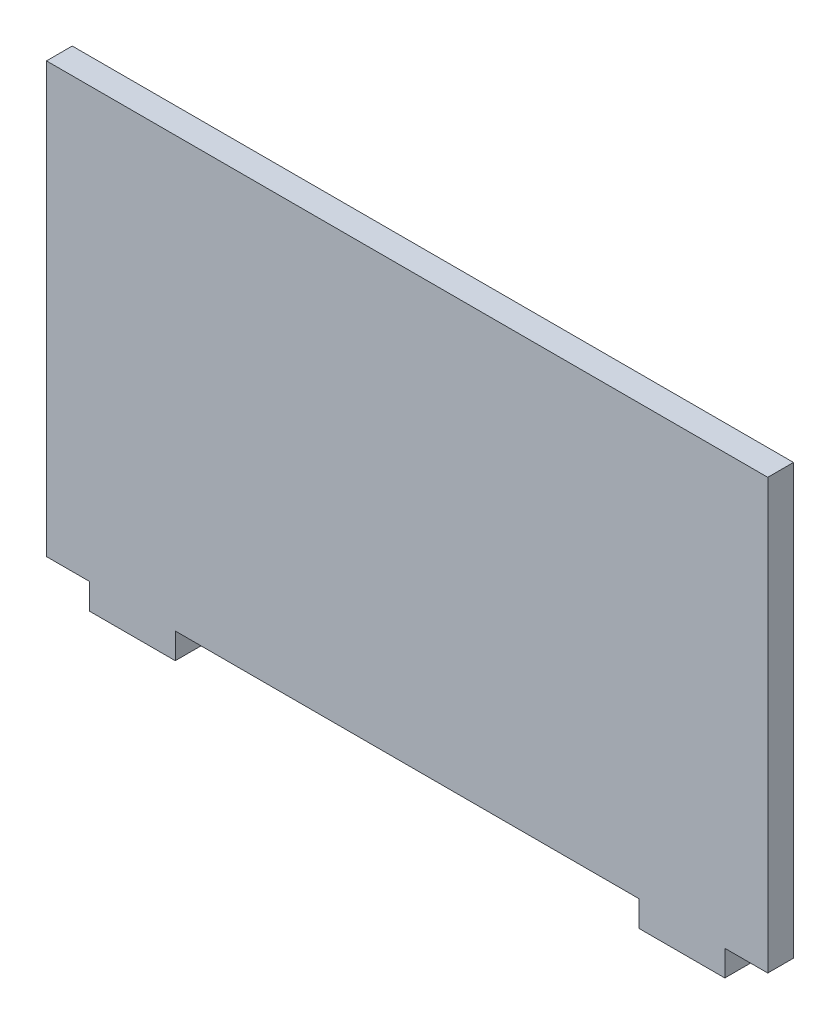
ISO-10303-21;
HEADER;
FILE_DESCRIPTION(('STEP AP214'),'2;1');
FILE_NAME('part.step','',(''),(''),'','','');
FILE_SCHEMA(('AUTOMOTIVE_DESIGN { 1 0 10303 214 1 1 1 1 }'));
ENDSEC;
DATA;
#1=APPLICATION_CONTEXT('core data for automotive mechanical design processes');
#2=APPLICATION_PROTOCOL_DEFINITION('international standard','automotive_design',2000,#1);
#3=PRODUCT_CONTEXT('',#1,'mechanical');
#4=PRODUCT('Part','Part','',(#3));
#5=PRODUCT_RELATED_PRODUCT_CATEGORY('part','',(#4));
#6=PRODUCT_DEFINITION_FORMATION('','',#4);
#7=PRODUCT_DEFINITION_CONTEXT('part definition',#1,'design');
#8=PRODUCT_DEFINITION('design','',#6,#7);
#9=PRODUCT_DEFINITION_SHAPE('','',#8);
#10=(LENGTH_UNIT() NAMED_UNIT(*) SI_UNIT(.MILLI.,.METRE.));
#11=(NAMED_UNIT(*) PLANE_ANGLE_UNIT() SI_UNIT($,.RADIAN.));
#12=(NAMED_UNIT(*) SI_UNIT($,.STERADIAN.) SOLID_ANGLE_UNIT());
#13=UNCERTAINTY_MEASURE_WITH_UNIT(LENGTH_MEASURE(1.E-05),#10,'distance_accuracy_value','');
#14=(GEOMETRIC_REPRESENTATION_CONTEXT(3) GLOBAL_UNCERTAINTY_ASSIGNED_CONTEXT((#13)) GLOBAL_UNIT_ASSIGNED_CONTEXT((#10,
#11,#12)) REPRESENTATION_CONTEXT('',''));
#15=CARTESIAN_POINT('',(0.,0.,0.));
#16=DIRECTION('',(0.,0.,1.));
#17=DIRECTION('',(1.,0.,0.));
#18=AXIS2_PLACEMENT_3D('',#15,#16,#17);
#19=CARTESIAN_POINT('',(1.90473212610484,-8.97164096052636,3.));
#20=DIRECTION('',(0.,1.,0.));
#21=DIRECTION('',(0.,0.,1.));
#22=AXIS2_PLACEMENT_3D('',#19,#20,#21);
#23=PLANE('',#22);
#24=DIRECTION('',(1.,0.,0.));
#25=VECTOR('',#24,1.);
#26=CARTESIAN_POINT('',(1.90473212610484,-8.97164096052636,0.));
#27=LINE('',#26,#25);
#28=CARTESIAN_POINT('',(1.90473212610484,-8.97164096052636,0.));
#29=VERTEX_POINT('',#28);
#30=CARTESIAN_POINT('',(6.90473212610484,-8.97164096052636,0.));
#31=VERTEX_POINT('',#30);
#32=EDGE_CURVE('E153',#29,#31,#27,.T.);
#33=ORIENTED_EDGE('',*,*,#32,.T.);
#34=DIRECTION('',(0.,0.,-1.));
#35=VECTOR('',#34,1.);
#36=CARTESIAN_POINT('',(6.90473212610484,-8.97164096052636,3.));
#37=LINE('',#36,#35);
#38=CARTESIAN_POINT('',(6.90473212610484,-8.97164096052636,3.));
#39=VERTEX_POINT('',#38);
#40=EDGE_CURVE('E11',#39,#31,#37,.T.);
#41=ORIENTED_EDGE('',*,*,#40,.F.);
#42=DIRECTION('',(1.,0.,0.));
#43=VECTOR('',#42,1.);
#44=CARTESIAN_POINT('',(1.90473212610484,-8.97164096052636,3.));
#45=LINE('',#44,#43);
#46=CARTESIAN_POINT('',(1.90473212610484,-8.97164096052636,3.));
#47=VERTEX_POINT('',#46);
#48=EDGE_CURVE('E175',#47,#39,#45,.T.);
#49=ORIENTED_EDGE('',*,*,#48,.F.);
#50=DIRECTION('',(0.,0.,-1.));
#51=VECTOR('',#50,1.);
#52=CARTESIAN_POINT('',(1.90473212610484,-8.97164096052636,3.));
#53=LINE('',#52,#51);
#54=EDGE_CURVE('E149',#47,#29,#53,.T.);
#55=ORIENTED_EDGE('',*,*,#54,.T.);
#56=EDGE_LOOP('',(#33,#41,#49,#55));
#57=FACE_BOUND('',#56,.T.);
#58=ADVANCED_FACE('F33',(#57),#23,.F.);
#59=CARTESIAN_POINT('',(6.90473212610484,-8.97164096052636,3.));
#60=DIRECTION('',(1.,0.,0.));
#61=DIRECTION('',(0.,0.,-1.));
#62=AXIS2_PLACEMENT_3D('',#59,#60,#61);
#63=PLANE('',#62);
#64=DIRECTION('',(0.,-1.,0.));
#65=VECTOR('',#64,1.);
#66=CARTESIAN_POINT('',(6.90473212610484,-8.97164096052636,0.));
#67=LINE('',#66,#65);
#68=CARTESIAN_POINT('',(6.90473212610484,-11.9716409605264,0.));
#69=VERTEX_POINT('',#68);
#70=EDGE_CURVE('E156',#31,#69,#67,.T.);
#71=ORIENTED_EDGE('',*,*,#70,.T.);
#72=DIRECTION('',(0.,0.,-1.));
#73=VECTOR('',#72,1.);
#74=CARTESIAN_POINT('',(6.90473212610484,-11.9716409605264,3.));
#75=LINE('',#74,#73);
#76=CARTESIAN_POINT('',(6.90473212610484,-11.9716409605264,3.));
#77=VERTEX_POINT('',#76);
#78=EDGE_CURVE('E41',#77,#69,#75,.T.);
#79=ORIENTED_EDGE('',*,*,#78,.F.);
#80=DIRECTION('',(0.,-1.,0.));
#81=VECTOR('',#80,1.);
#82=CARTESIAN_POINT('',(6.90473212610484,-8.97164096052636,3.));
#83=LINE('',#82,#81);
#84=EDGE_CURVE('E104',#39,#77,#83,.T.);
#85=ORIENTED_EDGE('',*,*,#84,.F.);
#86=ORIENTED_EDGE('',*,*,#40,.T.);
#87=EDGE_LOOP('',(#71,#79,#85,#86));
#88=FACE_BOUND('',#87,.T.);
#89=ADVANCED_FACE('F253',(#88),#63,.F.);
#90=CARTESIAN_POINT('',(6.90473212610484,-11.9716409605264,3.));
#91=DIRECTION('',(0.,1.,0.));
#92=DIRECTION('',(0.,0.,1.));
#93=AXIS2_PLACEMENT_3D('',#90,#91,#92);
#94=PLANE('',#93);
#95=DIRECTION('',(1.,0.,0.));
#96=VECTOR('',#95,1.);
#97=CARTESIAN_POINT('',(6.90473212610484,-11.9716409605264,0.));
#98=LINE('',#97,#96);
#99=CARTESIAN_POINT('',(16.9047321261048,-11.9716409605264,0.));
#100=VERTEX_POINT('',#99);
#101=EDGE_CURVE('E158',#69,#100,#98,.T.);
#102=ORIENTED_EDGE('',*,*,#101,.T.);
#103=DIRECTION('',(0.,0.,-1.));
#104=VECTOR('',#103,1.);
#105=CARTESIAN_POINT('',(16.9047321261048,-11.9716409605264,3.));
#106=LINE('',#105,#104);
#107=CARTESIAN_POINT('',(16.9047321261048,-11.9716409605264,3.));
#108=VERTEX_POINT('',#107);
#109=EDGE_CURVE('E194',#108,#100,#106,.T.);
#110=ORIENTED_EDGE('',*,*,#109,.F.);
#111=DIRECTION('',(1.,0.,0.));
#112=VECTOR('',#111,1.);
#113=CARTESIAN_POINT('',(6.90473212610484,-11.9716409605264,3.));
#114=LINE('',#113,#112);
#115=EDGE_CURVE('E202',#77,#108,#114,.T.);
#116=ORIENTED_EDGE('',*,*,#115,.F.);
#117=ORIENTED_EDGE('',*,*,#78,.T.);
#118=EDGE_LOOP('',(#102,#110,#116,#117));
#119=FACE_BOUND('',#118,.T.);
#120=ADVANCED_FACE('F200',(#119),#94,.F.);
#121=CARTESIAN_POINT('',(16.9047321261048,-11.9716409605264,3.));
#122=DIRECTION('',(-1.,0.,0.));
#123=DIRECTION('',(0.,0.,1.));
#124=AXIS2_PLACEMENT_3D('',#121,#122,#123);
#125=PLANE('',#124);
#126=DIRECTION('',(0.,1.,0.));
#127=VECTOR('',#126,1.);
#128=CARTESIAN_POINT('',(16.9047321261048,-11.9716409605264,0.));
#129=LINE('',#128,#127);
#130=CARTESIAN_POINT('',(16.9047321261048,-8.97164096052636,0.));
#131=VERTEX_POINT('',#130);
#132=EDGE_CURVE('E160',#100,#131,#129,.T.);
#133=ORIENTED_EDGE('',*,*,#132,.T.);
#134=DIRECTION('',(0.,0.,-1.));
#135=VECTOR('',#134,1.);
#136=CARTESIAN_POINT('',(16.9047321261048,-8.97164096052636,3.));
#137=LINE('',#136,#135);
#138=CARTESIAN_POINT('',(16.9047321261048,-8.97164096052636,3.));
#139=VERTEX_POINT('',#138);
#140=EDGE_CURVE('E191',#139,#131,#137,.T.);
#141=ORIENTED_EDGE('',*,*,#140,.F.);
#142=DIRECTION('',(0.,1.,0.));
#143=VECTOR('',#142,1.);
#144=CARTESIAN_POINT('',(16.9047321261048,-11.9716409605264,3.));
#145=LINE('',#144,#143);
#146=EDGE_CURVE('E220',#108,#139,#145,.T.);
#147=ORIENTED_EDGE('',*,*,#146,.F.);
#148=ORIENTED_EDGE('',*,*,#109,.T.);
#149=EDGE_LOOP('',(#133,#141,#147,#148));
#150=FACE_BOUND('',#149,.T.);
#151=ADVANCED_FACE('F211',(#150),#125,.F.);
#152=CARTESIAN_POINT('',(16.9047321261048,-8.97164096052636,3.));
#153=DIRECTION('',(0.,1.,0.));
#154=DIRECTION('',(0.,0.,1.));
#155=AXIS2_PLACEMENT_3D('',#152,#153,#154);
#156=PLANE('',#155);
#157=DIRECTION('',(1.,0.,0.));
#158=VECTOR('',#157,1.);
#159=CARTESIAN_POINT('',(16.9047321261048,-8.97164096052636,0.));
#160=LINE('',#159,#158);
#161=CARTESIAN_POINT('',(70.9047321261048,-8.97164096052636,0.));
#162=VERTEX_POINT('',#161);
#163=EDGE_CURVE('E162',#131,#162,#160,.T.);
#164=ORIENTED_EDGE('',*,*,#163,.T.);
#165=DIRECTION('',(0.,0.,-1.));
#166=VECTOR('',#165,1.);
#167=CARTESIAN_POINT('',(70.9047321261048,-8.97164096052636,3.));
#168=LINE('',#167,#166);
#169=CARTESIAN_POINT('',(70.9047321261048,-8.97164096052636,3.));
#170=VERTEX_POINT('',#169);
#171=EDGE_CURVE('E188',#170,#162,#168,.T.);
#172=ORIENTED_EDGE('',*,*,#171,.F.);
#173=DIRECTION('',(1.,0.,0.));
#174=VECTOR('',#173,1.);
#175=CARTESIAN_POINT('',(16.9047321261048,-8.97164096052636,3.));
#176=LINE('',#175,#174);
#177=EDGE_CURVE('E217',#139,#170,#176,.T.);
#178=ORIENTED_EDGE('',*,*,#177,.F.);
#179=ORIENTED_EDGE('',*,*,#140,.T.);
#180=EDGE_LOOP('',(#164,#172,#178,#179));
#181=FACE_BOUND('',#180,.T.);
#182=ADVANCED_FACE('F215',(#181),#156,.F.);
#183=CARTESIAN_POINT('',(70.9047321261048,-11.9716409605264,3.));
#184=DIRECTION('',(1.,0.,0.));
#185=DIRECTION('',(0.,1.,0.));
#186=AXIS2_PLACEMENT_3D('',#183,#184,#185);
#187=PLANE('',#186);
#188=DIRECTION('',(0.,-1.,0.));
#189=VECTOR('',#188,1.);
#190=CARTESIAN_POINT('',(70.9047321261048,-11.9716409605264,0.));
#191=LINE('',#190,#189);
#192=CARTESIAN_POINT('',(70.9047321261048,-11.9716409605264,0.));
#193=VERTEX_POINT('',#192);
#194=EDGE_CURVE('E164',#162,#193,#191,.T.);
#195=ORIENTED_EDGE('',*,*,#194,.T.);
#196=DIRECTION('',(0.,0.,-1.));
#197=VECTOR('',#196,1.);
#198=CARTESIAN_POINT('',(70.9047321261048,-11.9716409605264,3.));
#199=LINE('',#198,#197);
#200=CARTESIAN_POINT('',(70.9047321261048,-11.9716409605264,3.));
#201=VERTEX_POINT('',#200);
#202=EDGE_CURVE('E185',#201,#193,#199,.T.);
#203=ORIENTED_EDGE('',*,*,#202,.F.);
#204=DIRECTION('',(0.,-1.,0.));
#205=VECTOR('',#204,1.);
#206=CARTESIAN_POINT('',(70.9047321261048,-11.9716409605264,3.));
#207=LINE('',#206,#205);
#208=EDGE_CURVE('E219',#170,#201,#207,.T.);
#209=ORIENTED_EDGE('',*,*,#208,.F.);
#210=ORIENTED_EDGE('',*,*,#171,.T.);
#211=EDGE_LOOP('',(#195,#203,#209,#210));
#212=FACE_BOUND('',#211,.T.);
#213=ADVANCED_FACE('F266',(#212),#187,.F.);
#214=CARTESIAN_POINT('',(80.9047321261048,-11.9716409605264,3.));
#215=DIRECTION('',(0.,1.,0.));
#216=DIRECTION('',(-1.,0.,0.));
#217=AXIS2_PLACEMENT_3D('',#214,#215,#216);
#218=PLANE('',#217);
#219=DIRECTION('',(1.,0.,0.));
#220=VECTOR('',#219,1.);
#221=CARTESIAN_POINT('',(80.9047321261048,-11.9716409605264,0.));
#222=LINE('',#221,#220);
#223=CARTESIAN_POINT('',(80.9047321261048,-11.9716409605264,0.));
#224=VERTEX_POINT('',#223);
#225=EDGE_CURVE('E166',#193,#224,#222,.T.);
#226=ORIENTED_EDGE('',*,*,#225,.T.);
#227=DIRECTION('',(0.,0.,-1.));
#228=VECTOR('',#227,1.);
#229=CARTESIAN_POINT('',(80.9047321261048,-11.9716409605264,3.));
#230=LINE('',#229,#228);
#231=CARTESIAN_POINT('',(80.9047321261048,-11.9716409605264,3.));
#232=VERTEX_POINT('',#231);
#233=EDGE_CURVE('E182',#232,#224,#230,.T.);
#234=ORIENTED_EDGE('',*,*,#233,.F.);
#235=DIRECTION('',(1.,0.,0.));
#236=VECTOR('',#235,1.);
#237=CARTESIAN_POINT('',(80.9047321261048,-11.9716409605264,3.));
#238=LINE('',#237,#236);
#239=EDGE_CURVE('E222',#201,#232,#238,.T.);
#240=ORIENTED_EDGE('',*,*,#239,.F.);
#241=ORIENTED_EDGE('',*,*,#202,.T.);
#242=EDGE_LOOP('',(#226,#234,#240,#241));
#243=FACE_BOUND('',#242,.T.);
#244=ADVANCED_FACE('F269',(#243),#218,.F.);
#245=CARTESIAN_POINT('',(80.9047321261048,-8.97164096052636,3.));
#246=DIRECTION('',(-1.,0.,0.));
#247=DIRECTION('',(0.,0.,1.));
#248=AXIS2_PLACEMENT_3D('',#245,#246,#247);
#249=PLANE('',#248);
#250=DIRECTION('',(0.,1.,0.));
#251=VECTOR('',#250,1.);
#252=CARTESIAN_POINT('',(80.9047321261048,-8.97164096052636,0.));
#253=LINE('',#252,#251);
#254=CARTESIAN_POINT('',(80.9047321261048,-8.97164096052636,0.));
#255=VERTEX_POINT('',#254);
#256=EDGE_CURVE('E168',#224,#255,#253,.T.);
#257=ORIENTED_EDGE('',*,*,#256,.T.);
#258=DIRECTION('',(0.,0.,-1.));
#259=VECTOR('',#258,1.);
#260=CARTESIAN_POINT('',(80.9047321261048,-8.97164096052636,3.));
#261=LINE('',#260,#259);
#262=CARTESIAN_POINT('',(80.9047321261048,-8.97164096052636,3.));
#263=VERTEX_POINT('',#262);
#264=EDGE_CURVE('E179',#263,#255,#261,.T.);
#265=ORIENTED_EDGE('',*,*,#264,.F.);
#266=DIRECTION('',(0.,1.,0.));
#267=VECTOR('',#266,1.);
#268=CARTESIAN_POINT('',(80.9047321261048,-8.97164096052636,3.));
#269=LINE('',#268,#267);
#270=EDGE_CURVE('E228',#232,#263,#269,.T.);
#271=ORIENTED_EDGE('',*,*,#270,.F.);
#272=ORIENTED_EDGE('',*,*,#233,.T.);
#273=EDGE_LOOP('',(#257,#265,#271,#272));
#274=FACE_BOUND('',#273,.T.);
#275=ADVANCED_FACE('F234',(#274),#249,.F.);
#276=CARTESIAN_POINT('',(85.9047321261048,-8.97164096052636,3.));
#277=DIRECTION('',(0.,1.,0.));
#278=DIRECTION('',(0.,0.,1.));
#279=AXIS2_PLACEMENT_3D('',#276,#277,#278);
#280=PLANE('',#279);
#281=DIRECTION('',(1.,0.,0.));
#282=VECTOR('',#281,1.);
#283=CARTESIAN_POINT('',(85.9047321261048,-8.97164096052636,0.));
#284=LINE('',#283,#282);
#285=CARTESIAN_POINT('',(85.9047321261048,-8.97164096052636,0.));
#286=VERTEX_POINT('',#285);
#287=EDGE_CURVE('E170',#255,#286,#284,.T.);
#288=ORIENTED_EDGE('',*,*,#287,.T.);
#289=DIRECTION('',(0.,0.,-1.));
#290=VECTOR('',#289,1.);
#291=CARTESIAN_POINT('',(85.9047321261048,-8.97164096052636,3.));
#292=LINE('',#291,#290);
#293=CARTESIAN_POINT('',(85.9047321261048,-8.97164096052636,3.));
#294=VERTEX_POINT('',#293);
#295=EDGE_CURVE('E144',#294,#286,#292,.T.);
#296=ORIENTED_EDGE('',*,*,#295,.F.);
#297=DIRECTION('',(1.,0.,0.));
#298=VECTOR('',#297,1.);
#299=CARTESIAN_POINT('',(85.9047321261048,-8.97164096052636,3.));
#300=LINE('',#299,#298);
#301=EDGE_CURVE('E135',#263,#294,#300,.T.);
#302=ORIENTED_EDGE('',*,*,#301,.F.);
#303=ORIENTED_EDGE('',*,*,#264,.T.);
#304=EDGE_LOOP('',(#288,#296,#302,#303));
#305=FACE_BOUND('',#304,.T.);
#306=ADVANCED_FACE('F238',(#305),#280,.F.);
#307=CARTESIAN_POINT('',(85.9047321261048,-8.97164096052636,3.));
#308=DIRECTION('',(-1.,0.,0.));
#309=DIRECTION('',(0.,0.,1.));
#310=AXIS2_PLACEMENT_3D('',#307,#308,#309);
#311=PLANE('',#310);
#312=DIRECTION('',(0.,1.,0.));
#313=VECTOR('',#312,1.);
#314=CARTESIAN_POINT('',(85.9047321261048,-8.97164096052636,0.));
#315=LINE('',#314,#313);
#316=CARTESIAN_POINT('',(85.9047321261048,41.0283590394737,0.));
#317=VERTEX_POINT('',#316);
#318=EDGE_CURVE('E143',#286,#317,#315,.T.);
#319=ORIENTED_EDGE('',*,*,#318,.T.);
#320=DIRECTION('',(0.,0.,-1.));
#321=VECTOR('',#320,1.);
#322=CARTESIAN_POINT('',(85.9047321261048,41.0283590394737,3.));
#323=LINE('',#322,#321);
#324=CARTESIAN_POINT('',(85.9047321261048,41.0283590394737,3.));
#325=VERTEX_POINT('',#324);
#326=EDGE_CURVE('E140',#325,#317,#323,.T.);
#327=ORIENTED_EDGE('',*,*,#326,.F.);
#328=DIRECTION('',(0.,1.,0.));
#329=VECTOR('',#328,1.);
#330=CARTESIAN_POINT('',(85.9047321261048,-8.97164096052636,3.));
#331=LINE('',#330,#329);
#332=EDGE_CURVE('E129',#294,#325,#331,.T.);
#333=ORIENTED_EDGE('',*,*,#332,.F.);
#334=ORIENTED_EDGE('',*,*,#295,.T.);
#335=EDGE_LOOP('',(#319,#327,#333,#334));
#336=FACE_BOUND('',#335,.T.);
#337=ADVANCED_FACE('F141',(#336),#311,.F.);
#338=CARTESIAN_POINT('',(85.9047321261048,41.0283590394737,3.));
#339=DIRECTION('',(0.,-1.,0.));
#340=DIRECTION('',(1.,0.,0.));
#341=AXIS2_PLACEMENT_3D('',#338,#339,#340);
#342=PLANE('',#341);
#343=DIRECTION('',(-1.,0.,0.));
#344=VECTOR('',#343,1.);
#345=CARTESIAN_POINT('',(85.9047321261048,41.0283590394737,0.));
#346=LINE('',#345,#344);
#347=CARTESIAN_POINT('',(1.90473212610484,41.0283590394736,0.));
#348=VERTEX_POINT('',#347);
#349=EDGE_CURVE('E90',#317,#348,#346,.T.);
#350=ORIENTED_EDGE('',*,*,#349,.T.);
#351=DIRECTION('',(0.,0.,-1.));
#352=VECTOR('',#351,1.);
#353=CARTESIAN_POINT('',(1.90473212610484,41.0283590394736,3.));
#354=LINE('',#353,#352);
#355=CARTESIAN_POINT('',(1.90473212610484,41.0283590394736,3.));
#356=VERTEX_POINT('',#355);
#357=EDGE_CURVE('E145',#356,#348,#354,.T.);
#358=ORIENTED_EDGE('',*,*,#357,.F.);
#359=DIRECTION('',(-1.,0.,0.));
#360=VECTOR('',#359,1.);
#361=CARTESIAN_POINT('',(85.9047321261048,41.0283590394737,3.));
#362=LINE('',#361,#360);
#363=EDGE_CURVE('E133',#325,#356,#362,.T.);
#364=ORIENTED_EDGE('',*,*,#363,.F.);
#365=ORIENTED_EDGE('',*,*,#326,.T.);
#366=EDGE_LOOP('',(#350,#358,#364,#365));
#367=FACE_BOUND('',#366,.T.);
#368=ADVANCED_FACE('F147',(#367),#342,.F.);
#369=CARTESIAN_POINT('',(1.90473212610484,41.0283590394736,3.));
#370=DIRECTION('',(1.,0.,0.));
#371=DIRECTION('',(0.,0.,-1.));
#372=AXIS2_PLACEMENT_3D('',#369,#370,#371);
#373=PLANE('',#372);
#374=DIRECTION('',(0.,-1.,0.));
#375=VECTOR('',#374,1.);
#376=CARTESIAN_POINT('',(1.90473212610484,41.0283590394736,0.));
#377=LINE('',#376,#375);
#378=EDGE_CURVE('E96',#348,#29,#377,.T.);
#379=ORIENTED_EDGE('',*,*,#378,.T.);
#380=ORIENTED_EDGE('',*,*,#54,.F.);
#381=DIRECTION('',(0.,-1.,0.));
#382=VECTOR('',#381,1.);
#383=CARTESIAN_POINT('',(1.90473212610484,41.0283590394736,3.));
#384=LINE('',#383,#382);
#385=EDGE_CURVE('E49',#356,#47,#384,.T.);
#386=ORIENTED_EDGE('',*,*,#385,.F.);
#387=ORIENTED_EDGE('',*,*,#357,.T.);
#388=EDGE_LOOP('',(#379,#380,#386,#387));
#389=FACE_BOUND('',#388,.T.);
#390=ADVANCED_FACE('F242',(#389),#373,.F.);
#391=CARTESIAN_POINT('',(0.,0.,3.));
#392=DIRECTION('',(0.,0.,-1.));
#393=DIRECTION('',(-1.,0.,0.));
#394=AXIS2_PLACEMENT_3D('',#391,#392,#393);
#395=PLANE('',#394);
#396=ORIENTED_EDGE('',*,*,#48,.T.);
#397=ORIENTED_EDGE('',*,*,#84,.T.);
#398=ORIENTED_EDGE('',*,*,#115,.T.);
#399=ORIENTED_EDGE('',*,*,#146,.T.);
#400=ORIENTED_EDGE('',*,*,#177,.T.);
#401=ORIENTED_EDGE('',*,*,#208,.T.);
#402=ORIENTED_EDGE('',*,*,#239,.T.);
#403=ORIENTED_EDGE('',*,*,#270,.T.);
#404=ORIENTED_EDGE('',*,*,#301,.T.);
#405=ORIENTED_EDGE('',*,*,#332,.T.);
#406=ORIENTED_EDGE('',*,*,#363,.T.);
#407=ORIENTED_EDGE('',*,*,#385,.T.);
#408=EDGE_LOOP('',(#396,#397,#398,#399,#400,#401,#402,#403,#404,#405,#406,#407));
#409=FACE_BOUND('',#408,.T.);
#410=ADVANCED_FACE('F131',(#409),#395,.F.);
#411=CARTESIAN_POINT('',(0.,0.,0.));
#412=DIRECTION('',(0.,0.,-1.));
#413=DIRECTION('',(-1.,0.,0.));
#414=AXIS2_PLACEMENT_3D('',#411,#412,#413);
#415=PLANE('',#414);
#416=ORIENTED_EDGE('',*,*,#32,.F.);
#417=ORIENTED_EDGE('',*,*,#378,.F.);
#418=ORIENTED_EDGE('',*,*,#349,.F.);
#419=ORIENTED_EDGE('',*,*,#318,.F.);
#420=ORIENTED_EDGE('',*,*,#287,.F.);
#421=ORIENTED_EDGE('',*,*,#256,.F.);
#422=ORIENTED_EDGE('',*,*,#225,.F.);
#423=ORIENTED_EDGE('',*,*,#194,.F.);
#424=ORIENTED_EDGE('',*,*,#163,.F.);
#425=ORIENTED_EDGE('',*,*,#132,.F.);
#426=ORIENTED_EDGE('',*,*,#101,.F.);
#427=ORIENTED_EDGE('',*,*,#70,.F.);
#428=EDGE_LOOP('',(#416,#417,#418,#419,#420,#421,#422,#423,#424,#425,#426,#427));
#429=FACE_BOUND('',#428,.T.);
#430=ADVANCED_FACE('F206',(#429),#415,.T.);
#431=CLOSED_SHELL('',(#58,#89,#120,#151,#182,#213,#244,#275,#306,#337,#368,#390,#410,#430));
#432=MANIFOLD_SOLID_BREP('B2',#431);
#433=ADVANCED_BREP_SHAPE_REPRESENTATION('',(#18,#432),#14);
#434=SHAPE_DEFINITION_REPRESENTATION(#9,#433);
ENDSEC;
END-ISO-10303-21;
